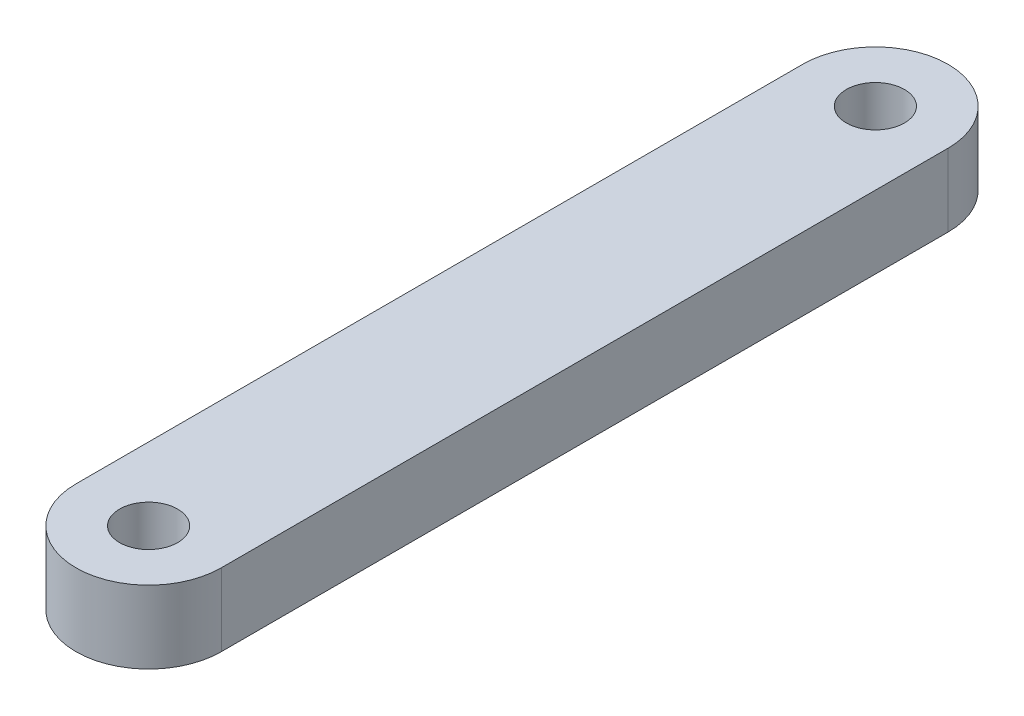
ISO-10303-21;
HEADER;
FILE_DESCRIPTION(('STEP AP214'),'2;1');
FILE_NAME('part.step','',(''),(''),'','','');
FILE_SCHEMA(('AUTOMOTIVE_DESIGN { 1 0 10303 214 1 1 1 1 }'));
ENDSEC;
DATA;
#1=APPLICATION_CONTEXT('core data for automotive mechanical design processes');
#2=APPLICATION_PROTOCOL_DEFINITION('international standard','automotive_design',2000,#1);
#3=PRODUCT_CONTEXT('',#1,'mechanical');
#4=PRODUCT('Part','Part','',(#3));
#5=PRODUCT_RELATED_PRODUCT_CATEGORY('part','',(#4));
#6=PRODUCT_DEFINITION_FORMATION('','',#4);
#7=PRODUCT_DEFINITION_CONTEXT('part definition',#1,'design');
#8=PRODUCT_DEFINITION('design','',#6,#7);
#9=PRODUCT_DEFINITION_SHAPE('','',#8);
#10=(LENGTH_UNIT() NAMED_UNIT(*) SI_UNIT(.MILLI.,.METRE.));
#11=(NAMED_UNIT(*) PLANE_ANGLE_UNIT() SI_UNIT($,.RADIAN.));
#12=(NAMED_UNIT(*) SI_UNIT($,.STERADIAN.) SOLID_ANGLE_UNIT());
#13=UNCERTAINTY_MEASURE_WITH_UNIT(LENGTH_MEASURE(1.E-05),#10,'distance_accuracy_value','');
#14=(GEOMETRIC_REPRESENTATION_CONTEXT(3) GLOBAL_UNCERTAINTY_ASSIGNED_CONTEXT((#13)) GLOBAL_UNIT_ASSIGNED_CONTEXT((#10,
#11,#12)) REPRESENTATION_CONTEXT('',''));
#15=CARTESIAN_POINT('',(0.,0.,0.));
#16=DIRECTION('',(0.,0.,1.));
#17=DIRECTION('',(1.,0.,0.));
#18=AXIS2_PLACEMENT_3D('',#15,#16,#17);
#19=CARTESIAN_POINT('',(0.,5.,25.));
#20=DIRECTION('',(0.,-1.,0.));
#21=DIRECTION('',(0.,0.,-1.));
#22=AXIS2_PLACEMENT_3D('',#19,#20,#21);
#23=PLANE('',#22);
#24=CARTESIAN_POINT('',(0.,5.,25.));
#25=DIRECTION('',(0.,1.,0.));
#26=DIRECTION('',(0.,0.,-1.));
#27=AXIS2_PLACEMENT_3D('',#24,#25,#26);
#28=CIRCLE('',#27,5.);
#29=CARTESIAN_POINT('',(-5.,5.,25.));
#30=VERTEX_POINT('',#29);
#31=CARTESIAN_POINT('',(5.,5.,25.));
#32=VERTEX_POINT('',#31);
#33=EDGE_CURVE('E98',#30,#32,#28,.T.);
#34=ORIENTED_EDGE('',*,*,#33,.T.);
#35=DIRECTION('',(0.,0.,-1.));
#36=VECTOR('',#35,1.);
#37=CARTESIAN_POINT('',(5.,5.,25.));
#38=LINE('',#37,#36);
#39=CARTESIAN_POINT('',(5.,5.,-25.));
#40=VERTEX_POINT('',#39);
#41=EDGE_CURVE('E91',#32,#40,#38,.T.);
#42=ORIENTED_EDGE('',*,*,#41,.T.);
#43=CARTESIAN_POINT('',(0.,5.,-25.));
#44=DIRECTION('',(0.,1.,0.));
#45=DIRECTION('',(0.,0.,1.));
#46=AXIS2_PLACEMENT_3D('',#43,#44,#45);
#47=CIRCLE('',#46,5.);
#48=CARTESIAN_POINT('',(-5.00000000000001,5.,-25.));
#49=VERTEX_POINT('',#48);
#50=EDGE_CURVE('E96',#40,#49,#47,.T.);
#51=ORIENTED_EDGE('',*,*,#50,.T.);
#52=DIRECTION('',(0.,0.,1.));
#53=VECTOR('',#52,1.);
#54=CARTESIAN_POINT('',(-5.,5.,25.));
#55=LINE('',#54,#53);
#56=EDGE_CURVE('E61',#49,#30,#55,.T.);
#57=ORIENTED_EDGE('',*,*,#56,.T.);
#58=EDGE_LOOP('',(#34,#42,#51,#57));
#59=FACE_BOUND('',#58,.T.);
#60=CARTESIAN_POINT('',(0.,5.,-25.));
#61=DIRECTION('',(0.,1.,0.));
#62=DIRECTION('',(0.,0.,1.));
#63=AXIS2_PLACEMENT_3D('',#60,#61,#62);
#64=CIRCLE('',#63,2.);
#65=CARTESIAN_POINT('',(0.,5.,-23.));
#66=VERTEX_POINT('',#65);
#67=EDGE_CURVE('E116',#66,#66,#64,.T.);
#68=ORIENTED_EDGE('',*,*,#67,.F.);
#69=EDGE_LOOP('',(#68));
#70=FACE_BOUND('',#69,.T.);
#71=CARTESIAN_POINT('',(0.,5.,25.));
#72=DIRECTION('',(0.,1.,0.));
#73=DIRECTION('',(0.,0.,1.));
#74=AXIS2_PLACEMENT_3D('',#71,#72,#73);
#75=CIRCLE('',#74,2.);
#76=CARTESIAN_POINT('',(0.,5.,27.));
#77=VERTEX_POINT('',#76);
#78=EDGE_CURVE('E137',#77,#77,#75,.T.);
#79=ORIENTED_EDGE('',*,*,#78,.F.);
#80=EDGE_LOOP('',(#79));
#81=FACE_BOUND('',#80,.T.);
#82=ADVANCED_FACE('F44',(#59,#70,#81),#23,.F.);
#83=CARTESIAN_POINT('',(0.,0.,25.));
#84=DIRECTION('',(0.,-1.,0.));
#85=DIRECTION('',(0.,0.,-1.));
#86=AXIS2_PLACEMENT_3D('',#83,#84,#85);
#87=PLANE('',#86);
#88=CARTESIAN_POINT('',(0.,0.,-25.));
#89=DIRECTION('',(0.,1.,0.));
#90=DIRECTION('',(0.,0.,1.));
#91=AXIS2_PLACEMENT_3D('',#88,#89,#90);
#92=CIRCLE('',#91,2.);
#93=CARTESIAN_POINT('',(0.,0.,-23.));
#94=VERTEX_POINT('',#93);
#95=EDGE_CURVE('E139',#94,#94,#92,.T.);
#96=ORIENTED_EDGE('',*,*,#95,.T.);
#97=EDGE_LOOP('',(#96));
#98=FACE_BOUND('',#97,.T.);
#99=CARTESIAN_POINT('',(0.,0.,25.));
#100=DIRECTION('',(0.,1.,0.));
#101=DIRECTION('',(0.,0.,-1.));
#102=AXIS2_PLACEMENT_3D('',#99,#100,#101);
#103=CIRCLE('',#102,5.);
#104=CARTESIAN_POINT('',(-5.,0.,25.));
#105=VERTEX_POINT('',#104);
#106=CARTESIAN_POINT('',(5.,0.,25.));
#107=VERTEX_POINT('',#106);
#108=EDGE_CURVE('E111',#105,#107,#103,.T.);
#109=ORIENTED_EDGE('',*,*,#108,.F.);
#110=DIRECTION('',(0.,0.,1.));
#111=VECTOR('',#110,1.);
#112=CARTESIAN_POINT('',(-5.,0.,25.));
#113=LINE('',#112,#111);
#114=CARTESIAN_POINT('',(-5.00000000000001,0.,-25.));
#115=VERTEX_POINT('',#114);
#116=EDGE_CURVE('E88',#115,#105,#113,.T.);
#117=ORIENTED_EDGE('',*,*,#116,.F.);
#118=CARTESIAN_POINT('',(0.,0.,-25.));
#119=DIRECTION('',(0.,1.,0.));
#120=DIRECTION('',(0.,0.,1.));
#121=AXIS2_PLACEMENT_3D('',#118,#119,#120);
#122=CIRCLE('',#121,5.);
#123=CARTESIAN_POINT('',(5.,0.,-25.));
#124=VERTEX_POINT('',#123);
#125=EDGE_CURVE('E77',#124,#115,#122,.T.);
#126=ORIENTED_EDGE('',*,*,#125,.F.);
#127=DIRECTION('',(0.,0.,-1.));
#128=VECTOR('',#127,1.);
#129=CARTESIAN_POINT('',(5.,0.,25.));
#130=LINE('',#129,#128);
#131=EDGE_CURVE('E103',#107,#124,#130,.T.);
#132=ORIENTED_EDGE('',*,*,#131,.F.);
#133=EDGE_LOOP('',(#109,#117,#126,#132));
#134=FACE_BOUND('',#133,.T.);
#135=CARTESIAN_POINT('',(0.,0.,25.));
#136=DIRECTION('',(0.,1.,0.));
#137=DIRECTION('',(0.,0.,1.));
#138=AXIS2_PLACEMENT_3D('',#135,#136,#137);
#139=CIRCLE('',#138,2.);
#140=CARTESIAN_POINT('',(0.,0.,27.));
#141=VERTEX_POINT('',#140);
#142=EDGE_CURVE('E145',#141,#141,#139,.T.);
#143=ORIENTED_EDGE('',*,*,#142,.T.);
#144=EDGE_LOOP('',(#143));
#145=FACE_BOUND('',#144,.T.);
#146=ADVANCED_FACE('F133',(#98,#134,#145),#87,.T.);
#147=CARTESIAN_POINT('',(0.,5.,25.));
#148=DIRECTION('',(0.,-1.,0.));
#149=DIRECTION('',(0.,0.,-1.));
#150=AXIS2_PLACEMENT_3D('',#147,#148,#149);
#151=CYLINDRICAL_SURFACE('',#150,5.);
#152=ORIENTED_EDGE('',*,*,#108,.T.);
#153=DIRECTION('',(0.,-1.,0.));
#154=VECTOR('',#153,1.);
#155=CARTESIAN_POINT('',(5.,5.,25.));
#156=LINE('',#155,#154);
#157=EDGE_CURVE('E11',#32,#107,#156,.T.);
#158=ORIENTED_EDGE('',*,*,#157,.F.);
#159=ORIENTED_EDGE('',*,*,#33,.F.);
#160=DIRECTION('',(0.,-1.,0.));
#161=VECTOR('',#160,1.);
#162=CARTESIAN_POINT('',(-5.,5.,25.));
#163=LINE('',#162,#161);
#164=EDGE_CURVE('E109',#30,#105,#163,.T.);
#165=ORIENTED_EDGE('',*,*,#164,.T.);
#166=EDGE_LOOP('',(#152,#158,#159,#165));
#167=FACE_BOUND('',#166,.T.);
#168=ADVANCED_FACE('F50',(#167),#151,.T.);
#169=CARTESIAN_POINT('',(5.,5.,25.));
#170=DIRECTION('',(-1.,0.,0.));
#171=DIRECTION('',(0.,0.,1.));
#172=AXIS2_PLACEMENT_3D('',#169,#170,#171);
#173=PLANE('',#172);
#174=ORIENTED_EDGE('',*,*,#131,.T.);
#175=DIRECTION('',(0.,-1.,0.));
#176=VECTOR('',#175,1.);
#177=CARTESIAN_POINT('',(5.,5.,-25.));
#178=LINE('',#177,#176);
#179=EDGE_CURVE('E54',#40,#124,#178,.T.);
#180=ORIENTED_EDGE('',*,*,#179,.F.);
#181=ORIENTED_EDGE('',*,*,#41,.F.);
#182=ORIENTED_EDGE('',*,*,#157,.T.);
#183=EDGE_LOOP('',(#174,#180,#181,#182));
#184=FACE_BOUND('',#183,.T.);
#185=ADVANCED_FACE('F105',(#184),#173,.F.);
#186=CARTESIAN_POINT('',(0.,5.,-25.));
#187=DIRECTION('',(0.,-1.,0.));
#188=DIRECTION('',(0.,0.,-1.));
#189=AXIS2_PLACEMENT_3D('',#186,#187,#188);
#190=CYLINDRICAL_SURFACE('',#189,5.);
#191=ORIENTED_EDGE('',*,*,#125,.T.);
#192=DIRECTION('',(0.,-1.,0.));
#193=VECTOR('',#192,1.);
#194=CARTESIAN_POINT('',(-5.00000000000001,5.,-25.));
#195=LINE('',#194,#193);
#196=EDGE_CURVE('E104',#49,#115,#195,.T.);
#197=ORIENTED_EDGE('',*,*,#196,.F.);
#198=ORIENTED_EDGE('',*,*,#50,.F.);
#199=ORIENTED_EDGE('',*,*,#179,.T.);
#200=EDGE_LOOP('',(#191,#197,#198,#199));
#201=FACE_BOUND('',#200,.T.);
#202=ADVANCED_FACE('F106',(#201),#190,.T.);
#203=CARTESIAN_POINT('',(-5.,5.,25.));
#204=DIRECTION('',(1.,0.,0.));
#205=DIRECTION('',(0.,0.,-1.));
#206=AXIS2_PLACEMENT_3D('',#203,#204,#205);
#207=PLANE('',#206);
#208=ORIENTED_EDGE('',*,*,#116,.T.);
#209=ORIENTED_EDGE('',*,*,#164,.F.);
#210=ORIENTED_EDGE('',*,*,#56,.F.);
#211=ORIENTED_EDGE('',*,*,#196,.T.);
#212=EDGE_LOOP('',(#208,#209,#210,#211));
#213=FACE_BOUND('',#212,.T.);
#214=ADVANCED_FACE('F126',(#213),#207,.F.);
#215=CARTESIAN_POINT('',(0.,5.,-25.));
#216=DIRECTION('',(0.,-1.,0.));
#217=DIRECTION('',(0.,0.,-1.));
#218=AXIS2_PLACEMENT_3D('',#215,#216,#217);
#219=CYLINDRICAL_SURFACE('',#218,2.);
#220=ORIENTED_EDGE('',*,*,#67,.T.);
#221=EDGE_LOOP('',(#220));
#222=FACE_BOUND('',#221,.T.);
#223=ORIENTED_EDGE('',*,*,#95,.F.);
#224=EDGE_LOOP('',(#223));
#225=FACE_BOUND('',#224,.T.);
#226=ADVANCED_FACE('F162',(#222,#225),#219,.F.);
#227=CARTESIAN_POINT('',(0.,5.,25.));
#228=DIRECTION('',(0.,-1.,0.));
#229=DIRECTION('',(0.,0.,-1.));
#230=AXIS2_PLACEMENT_3D('',#227,#228,#229);
#231=CYLINDRICAL_SURFACE('',#230,2.);
#232=ORIENTED_EDGE('',*,*,#78,.T.);
#233=EDGE_LOOP('',(#232));
#234=FACE_BOUND('',#233,.T.);
#235=ORIENTED_EDGE('',*,*,#142,.F.);
#236=EDGE_LOOP('',(#235));
#237=FACE_BOUND('',#236,.T.);
#238=ADVANCED_FACE('F155',(#234,#237),#231,.F.);
#239=CLOSED_SHELL('',(#82,#146,#168,#185,#202,#214,#226,#238));
#240=MANIFOLD_SOLID_BREP('B2',#239);
#241=ADVANCED_BREP_SHAPE_REPRESENTATION('',(#18,#240),#14);
#242=SHAPE_DEFINITION_REPRESENTATION(#9,#241);
ENDSEC;
END-ISO-10303-21;
